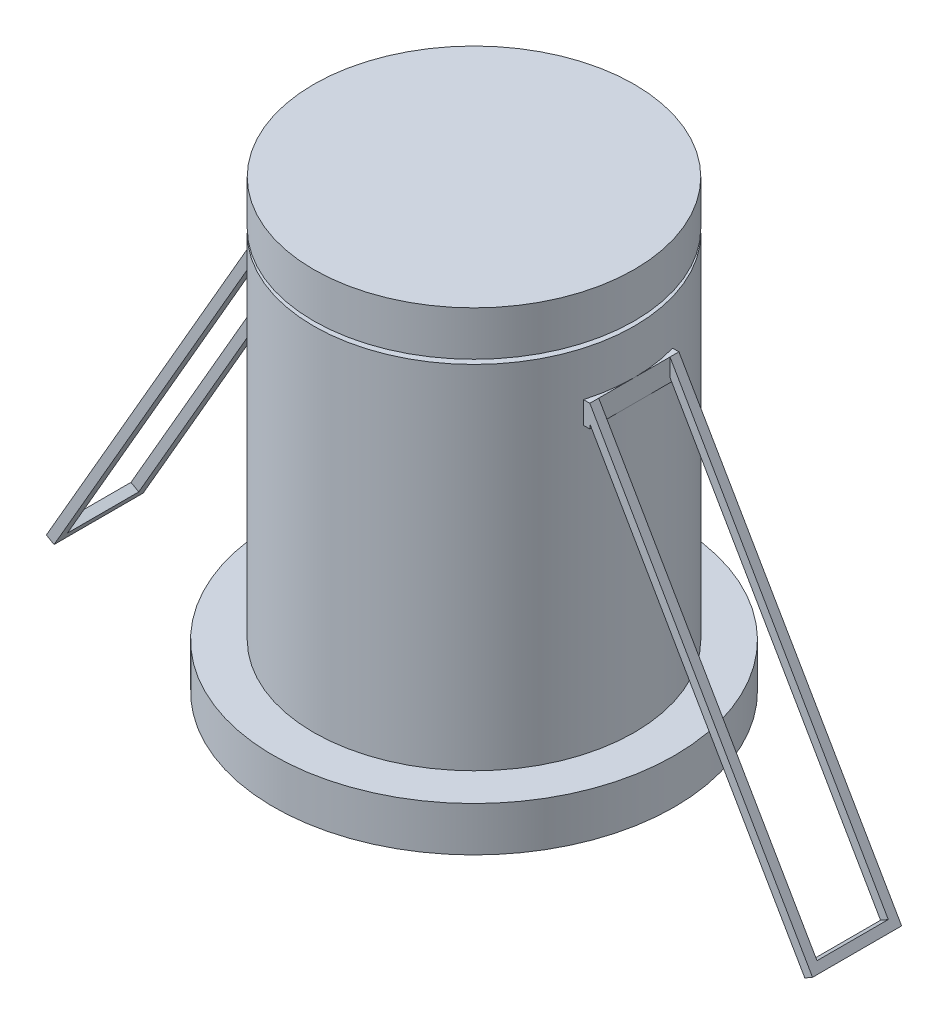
ISO-10303-21;
HEADER;
FILE_DESCRIPTION(('STEP AP214'),'2;1');
FILE_NAME('part.step','',(''),(''),'','','');
FILE_SCHEMA(('AUTOMOTIVE_DESIGN { 1 0 10303 214 1 1 1 1 }'));
ENDSEC;
DATA;
#1=APPLICATION_CONTEXT('core data for automotive mechanical design processes');
#2=APPLICATION_PROTOCOL_DEFINITION('international standard','automotive_design',2000,#1);
#3=PRODUCT_CONTEXT('',#1,'mechanical');
#4=PRODUCT('Part','Part','',(#3));
#5=PRODUCT_RELATED_PRODUCT_CATEGORY('part','',(#4));
#6=PRODUCT_DEFINITION_FORMATION('','',#4);
#7=PRODUCT_DEFINITION_CONTEXT('part definition',#1,'design');
#8=PRODUCT_DEFINITION('design','',#6,#7);
#9=PRODUCT_DEFINITION_SHAPE('','',#8);
#10=(LENGTH_UNIT() NAMED_UNIT(*) SI_UNIT(.MILLI.,.METRE.));
#11=(NAMED_UNIT(*) PLANE_ANGLE_UNIT() SI_UNIT($,.RADIAN.));
#12=(NAMED_UNIT(*) SI_UNIT($,.STERADIAN.) SOLID_ANGLE_UNIT());
#13=UNCERTAINTY_MEASURE_WITH_UNIT(LENGTH_MEASURE(1.E-05),#10,'distance_accuracy_value','');
#14=(GEOMETRIC_REPRESENTATION_CONTEXT(3) GLOBAL_UNCERTAINTY_ASSIGNED_CONTEXT((#13)) GLOBAL_UNIT_ASSIGNED_CONTEXT((#10,
#11,#12)) REPRESENTATION_CONTEXT('',''));
#15=CARTESIAN_POINT('',(0.,0.,0.));
#16=DIRECTION('',(0.,0.,1.));
#17=DIRECTION('',(1.,0.,0.));
#18=AXIS2_PLACEMENT_3D('',#15,#16,#17);
#19=CARTESIAN_POINT('',(-18.,0.,0.));
#20=DIRECTION('',(-1.,0.,0.));
#21=DIRECTION('',(0.,0.,-1.));
#22=AXIS2_PLACEMENT_3D('',#19,#20,#21);
#23=PLANE('',#22);
#24=DIRECTION('',(0.,0.,-1.));
#25=VECTOR('',#24,1.);
#26=CARTESIAN_POINT('',(-18.,37.5,0.));
#27=LINE('',#26,#25);
#28=CARTESIAN_POINT('',(-18.,37.5,5.));
#29=VERTEX_POINT('',#28);
#30=CARTESIAN_POINT('',(-18.,37.5,4.));
#31=VERTEX_POINT('',#30);
#32=EDGE_CURVE('E282',#29,#31,#27,.T.);
#33=ORIENTED_EDGE('',*,*,#32,.T.);
#34=DIRECTION('',(0.,1.,0.));
#35=VECTOR('',#34,1.);
#36=CARTESIAN_POINT('',(-18.,0.,4.));
#37=LINE('',#36,#35);
#38=CARTESIAN_POINT('',(-18.,39.5,4.));
#39=VERTEX_POINT('',#38);
#40=EDGE_CURVE('E232',#31,#39,#37,.T.);
#41=ORIENTED_EDGE('',*,*,#40,.T.);
#42=DIRECTION('',(0.,0.,1.));
#43=VECTOR('',#42,1.);
#44=CARTESIAN_POINT('',(-18.,39.5,-5.));
#45=LINE('',#44,#43);
#46=CARTESIAN_POINT('',(-18.,39.5,0.));
#47=VERTEX_POINT('',#46);
#48=EDGE_CURVE('E307',#47,#39,#45,.T.);
#49=ORIENTED_EDGE('',*,*,#48,.F.);
#50=DIRECTION('',(0.,0.,1.));
#51=VECTOR('',#50,1.);
#52=CARTESIAN_POINT('',(-18.,39.5,-5.));
#53=LINE('',#52,#51);
#54=CARTESIAN_POINT('',(-18.,39.5,-4.));
#55=VERTEX_POINT('',#54);
#56=EDGE_CURVE('E311',#55,#47,#53,.T.);
#57=ORIENTED_EDGE('',*,*,#56,.F.);
#58=DIRECTION('',(0.,-1.,0.));
#59=VECTOR('',#58,1.);
#60=CARTESIAN_POINT('',(-18.,0.,-4.));
#61=LINE('',#60,#59);
#62=CARTESIAN_POINT('',(-18.,37.5,-4.));
#63=VERTEX_POINT('',#62);
#64=EDGE_CURVE('E283',#55,#63,#61,.T.);
#65=ORIENTED_EDGE('',*,*,#64,.T.);
#66=CARTESIAN_POINT('',(-18.,37.5,-5.));
#67=VERTEX_POINT('',#66);
#68=EDGE_CURVE('E278',#63,#67,#27,.T.);
#69=ORIENTED_EDGE('',*,*,#68,.T.);
#70=DIRECTION('',(0.,1.,0.));
#71=VECTOR('',#70,1.);
#72=CARTESIAN_POINT('',(-18.,37.,-5.));
#73=LINE('',#72,#71);
#74=CARTESIAN_POINT('',(-18.,37.,-5.));
#75=VERTEX_POINT('',#74);
#76=EDGE_CURVE('E334',#75,#67,#73,.T.);
#77=ORIENTED_EDGE('',*,*,#76,.F.);
#78=DIRECTION('',(0.,0.,-1.));
#79=VECTOR('',#78,1.);
#80=CARTESIAN_POINT('',(-18.,37.,5.));
#81=LINE('',#80,#79);
#82=CARTESIAN_POINT('',(-18.,37.,0.));
#83=VERTEX_POINT('',#82);
#84=EDGE_CURVE('E338',#83,#75,#81,.T.);
#85=ORIENTED_EDGE('',*,*,#84,.F.);
#86=DIRECTION('',(0.,0.,-1.));
#87=VECTOR('',#86,1.);
#88=CARTESIAN_POINT('',(-18.,37.,5.));
#89=LINE('',#88,#87);
#90=CARTESIAN_POINT('',(-18.,37.,5.));
#91=VERTEX_POINT('',#90);
#92=EDGE_CURVE('E287',#91,#83,#89,.T.);
#93=ORIENTED_EDGE('',*,*,#92,.F.);
#94=DIRECTION('',(0.,-1.,0.));
#95=VECTOR('',#94,1.);
#96=CARTESIAN_POINT('',(-18.,39.5,5.));
#97=LINE('',#96,#95);
#98=EDGE_CURVE('E302',#29,#91,#97,.T.);
#99=ORIENTED_EDGE('',*,*,#98,.F.);
#100=EDGE_LOOP('',(#33,#41,#49,#57,#65,#69,#77,#85,#93,#99));
#101=FACE_BOUND('',#100,.T.);
#102=ADVANCED_FACE('F43',(#101),#23,.T.);
#103=CARTESIAN_POINT('',(0.,15.,0.));
#104=DIRECTION('',(0.,-1.,0.));
#105=DIRECTION('',(1.,0.,0.));
#106=AXIS2_PLACEMENT_3D('',#103,#104,#105);
#107=CYLINDRICAL_SURFACE('',#106,18.);
#108=CARTESIAN_POINT('',(0.,37.,0.));
#109=DIRECTION('',(0.,-1.,0.));
#110=DIRECTION('',(0.,0.,-1.));
#111=AXIS2_PLACEMENT_3D('',#108,#109,#110);
#112=CIRCLE('',#111,18.);
#113=CARTESIAN_POINT('',(18.,37.,0.));
#114=VERTEX_POINT('',#113);
#115=CARTESIAN_POINT('',(17.2916164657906,37.,5.));
#116=VERTEX_POINT('',#115);
#117=EDGE_CURVE('E443',#114,#116,#112,.T.);
#118=ORIENTED_EDGE('',*,*,#117,.T.);
#119=DIRECTION('',(0.,-1.,0.));
#120=VECTOR('',#119,1.);
#121=CARTESIAN_POINT('',(17.2916164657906,15.,5.));
#122=LINE('',#121,#120);
#123=CARTESIAN_POINT('',(17.2916164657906,39.5,5.));
#124=VERTEX_POINT('',#123);
#125=EDGE_CURVE('E439',#116,#124,#122,.F.);
#126=ORIENTED_EDGE('',*,*,#125,.T.);
#127=CARTESIAN_POINT('',(0.,39.5,0.));
#128=DIRECTION('',(0.,1.,0.));
#129=DIRECTION('',(0.,0.,1.));
#130=AXIS2_PLACEMENT_3D('',#127,#128,#129);
#131=CIRCLE('',#130,18.);
#132=CARTESIAN_POINT('',(18.,39.5,0.));
#133=VERTEX_POINT('',#132);
#134=EDGE_CURVE('E425',#124,#133,#131,.T.);
#135=ORIENTED_EDGE('',*,*,#134,.T.);
#136=CARTESIAN_POINT('',(0.,39.5,0.));
#137=DIRECTION('',(0.,1.,0.));
#138=DIRECTION('',(0.,0.,1.));
#139=AXIS2_PLACEMENT_3D('',#136,#137,#138);
#140=CIRCLE('',#139,18.);
#141=CARTESIAN_POINT('',(17.2916164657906,39.5,-5.));
#142=VERTEX_POINT('',#141);
#143=EDGE_CURVE('E466',#133,#142,#140,.T.);
#144=ORIENTED_EDGE('',*,*,#143,.T.);
#145=DIRECTION('',(0.,-1.,0.));
#146=VECTOR('',#145,1.);
#147=CARTESIAN_POINT('',(17.2916164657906,15.,-5.));
#148=LINE('',#147,#146);
#149=CARTESIAN_POINT('',(17.2916164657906,37.,-5.));
#150=VERTEX_POINT('',#149);
#151=EDGE_CURVE('E462',#142,#150,#148,.T.);
#152=ORIENTED_EDGE('',*,*,#151,.T.);
#153=CARTESIAN_POINT('',(0.,37.,0.));
#154=DIRECTION('',(0.,-1.,0.));
#155=DIRECTION('',(0.,0.,-1.));
#156=AXIS2_PLACEMENT_3D('',#153,#154,#155);
#157=CIRCLE('',#156,18.);
#158=EDGE_CURVE('E469',#150,#114,#157,.T.);
#159=ORIENTED_EDGE('',*,*,#158,.T.);
#160=EDGE_LOOP('',(#118,#126,#135,#144,#152,#159));
#161=FACE_BOUND('',#160,.T.);
#162=CARTESIAN_POINT('',(0.,44.5,0.));
#163=DIRECTION('',(0.,-1.,0.));
#164=DIRECTION('',(1.,0.,0.));
#165=AXIS2_PLACEMENT_3D('',#162,#163,#164);
#166=CIRCLE('',#165,18.);
#167=CARTESIAN_POINT('',(18.,44.5,0.));
#168=VERTEX_POINT('',#167);
#169=EDGE_CURVE('E52',#168,#168,#166,.T.);
#170=ORIENTED_EDGE('',*,*,#169,.T.);
#171=EDGE_LOOP('',(#170));
#172=FACE_BOUND('',#171,.T.);
#173=CARTESIAN_POINT('',(0.,5.,0.));
#174=DIRECTION('',(0.,-1.,0.));
#175=DIRECTION('',(1.,0.,0.));
#176=AXIS2_PLACEMENT_3D('',#173,#174,#175);
#177=CIRCLE('',#176,18.);
#178=CARTESIAN_POINT('',(18.,5.,0.));
#179=VERTEX_POINT('',#178);
#180=EDGE_CURVE('E505',#179,#179,#177,.T.);
#181=ORIENTED_EDGE('',*,*,#180,.F.);
#182=EDGE_LOOP('',(#181));
#183=FACE_BOUND('',#182,.T.);
#184=DIRECTION('',(0.,-1.,0.));
#185=VECTOR('',#184,1.);
#186=CARTESIAN_POINT('',(-17.2916164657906,15.,5.));
#187=LINE('',#186,#185);
#188=CARTESIAN_POINT('',(-17.2916164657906,37.,5.));
#189=VERTEX_POINT('',#188);
#190=CARTESIAN_POINT('',(-17.2916164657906,39.5,5.));
#191=VERTEX_POINT('',#190);
#192=EDGE_CURVE('E67',#189,#191,#187,.F.);
#193=ORIENTED_EDGE('',*,*,#192,.F.);
#194=CARTESIAN_POINT('',(0.,37.,0.));
#195=DIRECTION('',(0.,1.,0.));
#196=DIRECTION('',(0.,0.,1.));
#197=AXIS2_PLACEMENT_3D('',#194,#195,#196);
#198=CIRCLE('',#197,18.);
#199=EDGE_CURVE('E288',#83,#189,#198,.T.);
#200=ORIENTED_EDGE('',*,*,#199,.F.);
#201=CARTESIAN_POINT('',(0.,37.,0.));
#202=DIRECTION('',(0.,1.,0.));
#203=DIRECTION('',(0.,0.,1.));
#204=AXIS2_PLACEMENT_3D('',#201,#202,#203);
#205=CIRCLE('',#204,18.);
#206=CARTESIAN_POINT('',(-17.2916164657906,37.,-5.));
#207=VERTEX_POINT('',#206);
#208=EDGE_CURVE('E317',#207,#83,#205,.T.);
#209=ORIENTED_EDGE('',*,*,#208,.F.);
#210=DIRECTION('',(0.,-1.,0.));
#211=VECTOR('',#210,1.);
#212=CARTESIAN_POINT('',(-17.2916164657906,15.,-5.));
#213=LINE('',#212,#211);
#214=CARTESIAN_POINT('',(-17.2916164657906,39.5,-5.));
#215=VERTEX_POINT('',#214);
#216=EDGE_CURVE('E322',#215,#207,#213,.T.);
#217=ORIENTED_EDGE('',*,*,#216,.F.);
#218=CARTESIAN_POINT('',(0.,39.5,0.));
#219=DIRECTION('',(0.,-1.,0.));
#220=DIRECTION('',(0.,0.,-1.));
#221=AXIS2_PLACEMENT_3D('',#218,#219,#220);
#222=CIRCLE('',#221,18.);
#223=EDGE_CURVE('E323',#47,#215,#222,.T.);
#224=ORIENTED_EDGE('',*,*,#223,.F.);
#225=CARTESIAN_POINT('',(0.,39.5,0.));
#226=DIRECTION('',(0.,-1.,0.));
#227=DIRECTION('',(0.,0.,-1.));
#228=AXIS2_PLACEMENT_3D('',#225,#226,#227);
#229=CIRCLE('',#228,18.);
#230=EDGE_CURVE('E303',#191,#47,#229,.T.);
#231=ORIENTED_EDGE('',*,*,#230,.F.);
#232=EDGE_LOOP('',(#193,#200,#209,#217,#224,#231));
#233=FACE_BOUND('',#232,.T.);
#234=ADVANCED_FACE('F512',(#161,#172,#183,#233),#107,.T.);
#235=CARTESIAN_POINT('',(0.,15.,0.));
#236=DIRECTION('',(0.,-1.,0.));
#237=DIRECTION('',(1.,0.,0.));
#238=AXIS2_PLACEMENT_3D('',#235,#236,#237);
#239=CYLINDRICAL_SURFACE('',#238,17.);
#240=CARTESIAN_POINT('',(0.,44.5,0.));
#241=DIRECTION('',(0.,-1.,0.));
#242=DIRECTION('',(1.,0.,0.));
#243=AXIS2_PLACEMENT_3D('',#240,#241,#242);
#244=CIRCLE('',#243,17.);
#245=CARTESIAN_POINT('',(17.,44.5,0.));
#246=VERTEX_POINT('',#245);
#247=EDGE_CURVE('E11',#246,#246,#244,.T.);
#248=ORIENTED_EDGE('',*,*,#247,.F.);
#249=EDGE_LOOP('',(#248));
#250=FACE_BOUND('',#249,.T.);
#251=CARTESIAN_POINT('',(0.,45.,0.));
#252=DIRECTION('',(0.,-1.,0.));
#253=DIRECTION('',(1.,0.,0.));
#254=AXIS2_PLACEMENT_3D('',#251,#252,#253);
#255=CIRCLE('',#254,17.);
#256=CARTESIAN_POINT('',(17.,45.,0.));
#257=VERTEX_POINT('',#256);
#258=EDGE_CURVE('E465',#257,#257,#255,.T.);
#259=ORIENTED_EDGE('',*,*,#258,.T.);
#260=EDGE_LOOP('',(#259));
#261=FACE_BOUND('',#260,.T.);
#262=ADVANCED_FACE('F45',(#250,#261),#239,.T.);
#263=CARTESIAN_POINT('',(-3.08780778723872E-13,44.5,0.));
#264=DIRECTION('',(0.,-1.,0.));
#265=DIRECTION('',(1.,0.,0.));
#266=AXIS2_PLACEMENT_3D('',#263,#264,#265);
#267=PLANE('',#266);
#268=ORIENTED_EDGE('',*,*,#169,.F.);
#269=EDGE_LOOP('',(#268));
#270=FACE_BOUND('',#269,.T.);
#271=ORIENTED_EDGE('',*,*,#247,.T.);
#272=EDGE_LOOP('',(#271));
#273=FACE_BOUND('',#272,.T.);
#274=ADVANCED_FACE('F515',(#270,#273),#267,.F.);
#275=CARTESIAN_POINT('',(0.,5.,0.));
#276=DIRECTION('',(0.,1.,0.));
#277=DIRECTION('',(-1.,0.,0.));
#278=AXIS2_PLACEMENT_3D('',#275,#276,#277);
#279=PLANE('',#278);
#280=ORIENTED_EDGE('',*,*,#180,.T.);
#281=EDGE_LOOP('',(#280));
#282=FACE_BOUND('',#281,.T.);
#283=CARTESIAN_POINT('',(0.,5.,0.));
#284=DIRECTION('',(0.,-1.,0.));
#285=DIRECTION('',(1.,0.,0.));
#286=AXIS2_PLACEMENT_3D('',#283,#284,#285);
#287=CIRCLE('',#286,22.5);
#288=CARTESIAN_POINT('',(22.5,5.,0.));
#289=VERTEX_POINT('',#288);
#290=EDGE_CURVE('E501',#289,#289,#287,.T.);
#291=ORIENTED_EDGE('',*,*,#290,.F.);
#292=EDGE_LOOP('',(#291));
#293=FACE_BOUND('',#292,.T.);
#294=ADVANCED_FACE('F518',(#282,#293),#279,.T.);
#295=CARTESIAN_POINT('',(0.,15.,0.));
#296=DIRECTION('',(0.,-1.,0.));
#297=DIRECTION('',(1.,0.,0.));
#298=AXIS2_PLACEMENT_3D('',#295,#296,#297);
#299=CYLINDRICAL_SURFACE('',#298,22.5);
#300=ORIENTED_EDGE('',*,*,#290,.T.);
#301=EDGE_LOOP('',(#300));
#302=FACE_BOUND('',#301,.T.);
#303=CARTESIAN_POINT('',(0.,0.,0.));
#304=DIRECTION('',(0.,-1.,0.));
#305=DIRECTION('',(1.,0.,0.));
#306=AXIS2_PLACEMENT_3D('',#303,#304,#305);
#307=CIRCLE('',#306,22.5);
#308=CARTESIAN_POINT('',(22.5,0.,0.));
#309=VERTEX_POINT('',#308);
#310=EDGE_CURVE('E497',#309,#309,#307,.T.);
#311=ORIENTED_EDGE('',*,*,#310,.F.);
#312=EDGE_LOOP('',(#311));
#313=FACE_BOUND('',#312,.T.);
#314=ADVANCED_FACE('F793',(#302,#313),#299,.T.);
#315=CARTESIAN_POINT('',(0.,0.,0.));
#316=DIRECTION('',(0.,-1.,0.));
#317=DIRECTION('',(1.,0.,0.));
#318=AXIS2_PLACEMENT_3D('',#315,#316,#317);
#319=PLANE('',#318);
#320=ORIENTED_EDGE('',*,*,#310,.T.);
#321=EDGE_LOOP('',(#320));
#322=FACE_BOUND('',#321,.T.);
#323=CARTESIAN_POINT('',(0.,0.,0.));
#324=DIRECTION('',(0.,-1.,0.));
#325=DIRECTION('',(1.,0.,0.));
#326=AXIS2_PLACEMENT_3D('',#323,#324,#325);
#327=CIRCLE('',#326,15.);
#328=CARTESIAN_POINT('',(15.,0.,0.));
#329=VERTEX_POINT('',#328);
#330=EDGE_CURVE('E493',#329,#329,#327,.T.);
#331=ORIENTED_EDGE('',*,*,#330,.F.);
#332=EDGE_LOOP('',(#331));
#333=FACE_BOUND('',#332,.T.);
#334=ADVANCED_FACE('F801',(#322,#333),#319,.T.);
#335=CARTESIAN_POINT('',(0.,15.,0.));
#336=DIRECTION('',(0.,-1.,0.));
#337=DIRECTION('',(1.,0.,0.));
#338=AXIS2_PLACEMENT_3D('',#335,#336,#337);
#339=CYLINDRICAL_SURFACE('',#338,15.);
#340=CARTESIAN_POINT('',(0.,15.,0.));
#341=DIRECTION('',(0.,-1.,0.));
#342=DIRECTION('',(1.,0.,0.));
#343=AXIS2_PLACEMENT_3D('',#340,#341,#342);
#344=CIRCLE('',#343,15.);
#345=CARTESIAN_POINT('',(15.,15.,0.));
#346=VERTEX_POINT('',#345);
#347=EDGE_CURVE('E489',#346,#346,#344,.T.);
#348=ORIENTED_EDGE('',*,*,#347,.F.);
#349=EDGE_LOOP('',(#348));
#350=FACE_BOUND('',#349,.T.);
#351=ORIENTED_EDGE('',*,*,#330,.T.);
#352=EDGE_LOOP('',(#351));
#353=FACE_BOUND('',#352,.T.);
#354=ADVANCED_FACE('F545',(#350,#353),#339,.F.);
#355=CARTESIAN_POINT('',(0.,15.,0.));
#356=DIRECTION('',(0.,1.,0.));
#357=DIRECTION('',(-1.,0.,0.));
#358=AXIS2_PLACEMENT_3D('',#355,#356,#357);
#359=PLANE('',#358);
#360=ORIENTED_EDGE('',*,*,#347,.T.);
#361=EDGE_LOOP('',(#360));
#362=FACE_BOUND('',#361,.T.);
#363=ADVANCED_FACE('F540',(#362),#359,.F.);
#364=CARTESIAN_POINT('',(0.,50.,0.));
#365=DIRECTION('',(0.,1.,0.));
#366=DIRECTION('',(-1.,0.,0.));
#367=AXIS2_PLACEMENT_3D('',#364,#365,#366);
#368=PLANE('',#367);
#369=CARTESIAN_POINT('',(0.,50.,0.));
#370=DIRECTION('',(0.,-1.,0.));
#371=DIRECTION('',(1.,0.,0.));
#372=AXIS2_PLACEMENT_3D('',#369,#370,#371);
#373=CIRCLE('',#372,18.);
#374=CARTESIAN_POINT('',(18.,50.,0.));
#375=VERTEX_POINT('',#374);
#376=EDGE_CURVE('E485',#375,#375,#373,.T.);
#377=ORIENTED_EDGE('',*,*,#376,.F.);
#378=EDGE_LOOP('',(#377));
#379=FACE_BOUND('',#378,.T.);
#380=ADVANCED_FACE('F535',(#379),#368,.T.);
#381=CARTESIAN_POINT('',(0.,15.,0.));
#382=DIRECTION('',(0.,-1.,0.));
#383=DIRECTION('',(1.,0.,0.));
#384=AXIS2_PLACEMENT_3D('',#381,#382,#383);
#385=CYLINDRICAL_SURFACE('',#384,18.);
#386=CARTESIAN_POINT('',(0.,45.,0.));
#387=DIRECTION('',(0.,-1.,0.));
#388=DIRECTION('',(1.,0.,0.));
#389=AXIS2_PLACEMENT_3D('',#386,#387,#388);
#390=CIRCLE('',#389,18.);
#391=CARTESIAN_POINT('',(18.,45.,0.));
#392=VERTEX_POINT('',#391);
#393=EDGE_CURVE('E481',#392,#392,#390,.T.);
#394=ORIENTED_EDGE('',*,*,#393,.F.);
#395=EDGE_LOOP('',(#394));
#396=FACE_BOUND('',#395,.T.);
#397=ORIENTED_EDGE('',*,*,#376,.T.);
#398=EDGE_LOOP('',(#397));
#399=FACE_BOUND('',#398,.T.);
#400=ADVANCED_FACE('F529',(#396,#399),#385,.T.);
#401=CARTESIAN_POINT('',(0.,45.,0.));
#402=DIRECTION('',(0.,1.,0.));
#403=DIRECTION('',(-1.,0.,0.));
#404=AXIS2_PLACEMENT_3D('',#401,#402,#403);
#405=PLANE('',#404);
#406=ORIENTED_EDGE('',*,*,#258,.F.);
#407=EDGE_LOOP('',(#406));
#408=FACE_BOUND('',#407,.T.);
#409=ORIENTED_EDGE('',*,*,#393,.T.);
#410=EDGE_LOOP('',(#409));
#411=FACE_BOUND('',#410,.T.);
#412=ADVANCED_FACE('F525',(#408,#411),#405,.F.);
#413=CARTESIAN_POINT('',(18.,0.,0.));
#414=DIRECTION('',(1.,0.,0.));
#415=DIRECTION('',(0.,0.,-1.));
#416=AXIS2_PLACEMENT_3D('',#413,#414,#415);
#417=PLANE('',#416);
#418=DIRECTION('',(0.,-1.,0.));
#419=VECTOR('',#418,1.);
#420=CARTESIAN_POINT('',(18.,0.,-4.));
#421=LINE('',#420,#419);
#422=CARTESIAN_POINT('',(18.,39.5,-4.));
#423=VERTEX_POINT('',#422);
#424=CARTESIAN_POINT('',(18.,37.5,-4.));
#425=VERTEX_POINT('',#424);
#426=EDGE_CURVE('E417',#423,#425,#421,.T.);
#427=ORIENTED_EDGE('',*,*,#426,.F.);
#428=DIRECTION('',(0.,0.,1.));
#429=VECTOR('',#428,1.);
#430=CARTESIAN_POINT('',(18.,39.5,-5.));
#431=LINE('',#430,#429);
#432=EDGE_CURVE('E442',#423,#133,#431,.T.);
#433=ORIENTED_EDGE('',*,*,#432,.T.);
#434=DIRECTION('',(0.,0.,1.));
#435=VECTOR('',#434,1.);
#436=CARTESIAN_POINT('',(18.,39.5,-5.));
#437=LINE('',#436,#435);
#438=CARTESIAN_POINT('',(18.,39.5,4.));
#439=VERTEX_POINT('',#438);
#440=EDGE_CURVE('E421',#133,#439,#437,.T.);
#441=ORIENTED_EDGE('',*,*,#440,.T.);
#442=DIRECTION('',(0.,1.,0.));
#443=VECTOR('',#442,1.);
#444=CARTESIAN_POINT('',(18.,0.,4.));
#445=LINE('',#444,#443);
#446=CARTESIAN_POINT('',(18.,37.5,4.));
#447=VERTEX_POINT('',#446);
#448=EDGE_CURVE('E401',#447,#439,#445,.T.);
#449=ORIENTED_EDGE('',*,*,#448,.F.);
#450=DIRECTION('',(0.,0.,1.));
#451=VECTOR('',#450,1.);
#452=CARTESIAN_POINT('',(18.,37.5,0.));
#453=LINE('',#452,#451);
#454=CARTESIAN_POINT('',(18.,37.5,5.));
#455=VERTEX_POINT('',#454);
#456=EDGE_CURVE('E413',#447,#455,#453,.T.);
#457=ORIENTED_EDGE('',*,*,#456,.T.);
#458=DIRECTION('',(0.,-1.,0.));
#459=VECTOR('',#458,1.);
#460=CARTESIAN_POINT('',(18.,39.5,5.));
#461=LINE('',#460,#459);
#462=CARTESIAN_POINT('',(18.,37.,5.));
#463=VERTEX_POINT('',#462);
#464=EDGE_CURVE('E433',#455,#463,#461,.T.);
#465=ORIENTED_EDGE('',*,*,#464,.T.);
#466=DIRECTION('',(0.,0.,-1.));
#467=VECTOR('',#466,1.);
#468=CARTESIAN_POINT('',(18.,37.,5.));
#469=LINE('',#468,#467);
#470=EDGE_CURVE('E430',#463,#114,#469,.T.);
#471=ORIENTED_EDGE('',*,*,#470,.T.);
#472=DIRECTION('',(0.,0.,-1.));
#473=VECTOR('',#472,1.);
#474=CARTESIAN_POINT('',(18.,37.,5.));
#475=LINE('',#474,#473);
#476=CARTESIAN_POINT('',(18.,37.,-5.));
#477=VERTEX_POINT('',#476);
#478=EDGE_CURVE('E454',#114,#477,#475,.T.);
#479=ORIENTED_EDGE('',*,*,#478,.T.);
#480=DIRECTION('',(0.,1.,0.));
#481=VECTOR('',#480,1.);
#482=CARTESIAN_POINT('',(18.,37.,-5.));
#483=LINE('',#482,#481);
#484=CARTESIAN_POINT('',(18.,37.5,-5.));
#485=VERTEX_POINT('',#484);
#486=EDGE_CURVE('E450',#477,#485,#483,.T.);
#487=ORIENTED_EDGE('',*,*,#486,.T.);
#488=EDGE_CURVE('E416',#485,#425,#453,.T.);
#489=ORIENTED_EDGE('',*,*,#488,.T.);
#490=EDGE_LOOP('',(#427,#433,#441,#449,#457,#465,#471,#479,#487,#489));
#491=FACE_BOUND('',#490,.T.);
#492=ADVANCED_FACE('F528',(#491),#417,.T.);
#493=CARTESIAN_POINT('',(-22.501,37.,5.));
#494=DIRECTION('',(0.,-1.,0.));
#495=DIRECTION('',(0.,0.,-1.));
#496=AXIS2_PLACEMENT_3D('',#493,#494,#495);
#497=PLANE('',#496);
#498=ORIENTED_EDGE('',*,*,#158,.F.);
#499=DIRECTION('',(1.,0.,0.));
#500=VECTOR('',#499,1.);
#501=CARTESIAN_POINT('',(-22.501,37.,-5.));
#502=LINE('',#501,#500);
#503=EDGE_CURVE('E453',#150,#477,#502,.T.);
#504=ORIENTED_EDGE('',*,*,#503,.T.);
#505=ORIENTED_EDGE('',*,*,#478,.F.);
#506=EDGE_LOOP('',(#498,#504,#505));
#507=FACE_BOUND('',#506,.T.);
#508=ADVANCED_FACE('F612',(#507),#497,.T.);
#509=CARTESIAN_POINT('',(-22.501,37.,-5.));
#510=DIRECTION('',(0.,0.,-1.));
#511=DIRECTION('',(-1.,0.,0.));
#512=AXIS2_PLACEMENT_3D('',#509,#510,#511);
#513=PLANE('',#512);
#514=DIRECTION('',(1.,0.,0.));
#515=VECTOR('',#514,1.);
#516=CARTESIAN_POINT('',(-22.501,39.5,-5.));
#517=LINE('',#516,#515);
#518=CARTESIAN_POINT('',(18.,39.5,-5.));
#519=VERTEX_POINT('',#518);
#520=EDGE_CURVE('E473',#142,#519,#517,.T.);
#521=ORIENTED_EDGE('',*,*,#520,.T.);
#522=DIRECTION('',(-0.500000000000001,0.866025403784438,0.));
#523=VECTOR('',#522,1.);
#524=CARTESIAN_POINT('',(18.,39.5,-5.));
#525=LINE('',#524,#523);
#526=CARTESIAN_POINT('',(43.,-3.80127018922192,-5.));
#527=VERTEX_POINT('',#526);
#528=EDGE_CURVE('E383',#527,#519,#525,.T.);
#529=ORIENTED_EDGE('',*,*,#528,.F.);
#530=DIRECTION('',(0.866025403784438,0.500000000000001,0.));
#531=VECTOR('',#530,1.);
#532=CARTESIAN_POINT('',(42.1339745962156,-4.30127018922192,-5.));
#533=LINE('',#532,#531);
#534=CARTESIAN_POINT('',(42.1339745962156,-4.30127018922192,-5.));
#535=VERTEX_POINT('',#534);
#536=EDGE_CURVE('E405',#535,#527,#533,.T.);
#537=ORIENTED_EDGE('',*,*,#536,.F.);
#538=DIRECTION('',(-0.500000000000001,0.866025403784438,0.));
#539=VECTOR('',#538,1.);
#540=CARTESIAN_POINT('',(17.1339745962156,39.,-5.));
#541=LINE('',#540,#539);
#542=EDGE_CURVE('E356',#535,#485,#541,.T.);
#543=ORIENTED_EDGE('',*,*,#542,.T.);
#544=ORIENTED_EDGE('',*,*,#486,.F.);
#545=ORIENTED_EDGE('',*,*,#503,.F.);
#546=ORIENTED_EDGE('',*,*,#151,.F.);
#547=EDGE_LOOP('',(#521,#529,#537,#543,#544,#545,#546));
#548=FACE_BOUND('',#547,.T.);
#549=ADVANCED_FACE('F616',(#548),#513,.T.);
#550=CARTESIAN_POINT('',(-22.501,39.5,-5.));
#551=DIRECTION('',(0.,1.,0.));
#552=DIRECTION('',(0.,0.,1.));
#553=AXIS2_PLACEMENT_3D('',#550,#551,#552);
#554=PLANE('',#553);
#555=ORIENTED_EDGE('',*,*,#143,.F.);
#556=ORIENTED_EDGE('',*,*,#432,.F.);
#557=EDGE_CURVE('E458',#519,#423,#431,.T.);
#558=ORIENTED_EDGE('',*,*,#557,.F.);
#559=ORIENTED_EDGE('',*,*,#520,.F.);
#560=EDGE_LOOP('',(#555,#556,#558,#559));
#561=FACE_BOUND('',#560,.T.);
#562=ADVANCED_FACE('F605',(#561),#554,.T.);
#563=CARTESIAN_POINT('',(-22.501,39.5,5.));
#564=DIRECTION('',(0.,0.,1.));
#565=DIRECTION('',(1.,0.,0.));
#566=AXIS2_PLACEMENT_3D('',#563,#564,#565);
#567=PLANE('',#566);
#568=DIRECTION('',(1.,0.,0.));
#569=VECTOR('',#568,1.);
#570=CARTESIAN_POINT('',(-22.501,39.5,5.));
#571=LINE('',#570,#569);
#572=CARTESIAN_POINT('',(18.,39.5,5.));
#573=VERTEX_POINT('',#572);
#574=EDGE_CURVE('E422',#124,#573,#571,.T.);
#575=ORIENTED_EDGE('',*,*,#574,.F.);
#576=ORIENTED_EDGE('',*,*,#125,.F.);
#577=DIRECTION('',(1.,0.,0.));
#578=VECTOR('',#577,1.);
#579=CARTESIAN_POINT('',(-22.501,37.,5.));
#580=LINE('',#579,#578);
#581=EDGE_CURVE('E426',#116,#463,#580,.T.);
#582=ORIENTED_EDGE('',*,*,#581,.T.);
#583=ORIENTED_EDGE('',*,*,#464,.F.);
#584=DIRECTION('',(0.500000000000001,-0.866025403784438,0.));
#585=VECTOR('',#584,1.);
#586=CARTESIAN_POINT('',(17.1339745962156,39.,5.));
#587=LINE('',#586,#585);
#588=CARTESIAN_POINT('',(42.1339745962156,-4.30127018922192,5.));
#589=VERTEX_POINT('',#588);
#590=EDGE_CURVE('E348',#455,#589,#587,.T.);
#591=ORIENTED_EDGE('',*,*,#590,.T.);
#592=DIRECTION('',(0.866025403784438,0.500000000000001,0.));
#593=VECTOR('',#592,1.);
#594=CARTESIAN_POINT('',(42.1339745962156,-4.30127018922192,5.));
#595=LINE('',#594,#593);
#596=CARTESIAN_POINT('',(43.,-3.80127018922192,5.));
#597=VERTEX_POINT('',#596);
#598=EDGE_CURVE('E371',#589,#597,#595,.T.);
#599=ORIENTED_EDGE('',*,*,#598,.T.);
#600=DIRECTION('',(0.500000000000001,-0.866025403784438,0.));
#601=VECTOR('',#600,1.);
#602=CARTESIAN_POINT('',(18.,39.5,5.));
#603=LINE('',#602,#601);
#604=EDGE_CURVE('E375',#573,#597,#603,.T.);
#605=ORIENTED_EDGE('',*,*,#604,.F.);
#606=EDGE_LOOP('',(#575,#576,#582,#583,#591,#599,#605));
#607=FACE_BOUND('',#606,.T.);
#608=ADVANCED_FACE('F602',(#607),#567,.T.);
#609=CARTESIAN_POINT('',(-22.501,37.,5.));
#610=DIRECTION('',(0.,-1.,0.));
#611=DIRECTION('',(0.,0.,-1.));
#612=AXIS2_PLACEMENT_3D('',#609,#610,#611);
#613=PLANE('',#612);
#614=ORIENTED_EDGE('',*,*,#117,.F.);
#615=ORIENTED_EDGE('',*,*,#470,.F.);
#616=ORIENTED_EDGE('',*,*,#581,.F.);
#617=EDGE_LOOP('',(#614,#615,#616));
#618=FACE_BOUND('',#617,.T.);
#619=ADVANCED_FACE('F600',(#618),#613,.T.);
#620=CARTESIAN_POINT('',(-22.501,39.5,-5.));
#621=DIRECTION('',(0.,1.,0.));
#622=DIRECTION('',(0.,0.,1.));
#623=AXIS2_PLACEMENT_3D('',#620,#621,#622);
#624=PLANE('',#623);
#625=ORIENTED_EDGE('',*,*,#134,.F.);
#626=ORIENTED_EDGE('',*,*,#574,.T.);
#627=DIRECTION('',(0.,0.,1.));
#628=VECTOR('',#627,1.);
#629=CARTESIAN_POINT('',(18.,39.5,4.));
#630=LINE('',#629,#628);
#631=EDGE_CURVE('E321',#439,#573,#630,.T.);
#632=ORIENTED_EDGE('',*,*,#631,.F.);
#633=ORIENTED_EDGE('',*,*,#440,.F.);
#634=EDGE_LOOP('',(#625,#626,#632,#633));
#635=FACE_BOUND('',#634,.T.);
#636=ADVANCED_FACE('F586',(#635),#624,.T.);
#637=CARTESIAN_POINT('',(17.1339745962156,39.,4.));
#638=DIRECTION('',(0.,0.,-1.));
#639=DIRECTION('',(-1.,0.,0.));
#640=AXIS2_PLACEMENT_3D('',#637,#638,#639);
#641=PLANE('',#640);
#642=DIRECTION('',(-0.500000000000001,0.866025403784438,0.));
#643=VECTOR('',#642,1.);
#644=CARTESIAN_POINT('',(17.1339745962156,39.,4.));
#645=LINE('',#644,#643);
#646=CARTESIAN_POINT('',(41.6339745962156,-3.43524478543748,4.));
#647=VERTEX_POINT('',#646);
#648=EDGE_CURVE('E367',#647,#447,#645,.T.);
#649=ORIENTED_EDGE('',*,*,#648,.T.);
#650=ORIENTED_EDGE('',*,*,#448,.T.);
#651=DIRECTION('',(-0.500000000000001,0.866025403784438,0.));
#652=VECTOR('',#651,1.);
#653=CARTESIAN_POINT('',(18.,39.5,4.));
#654=LINE('',#653,#652);
#655=CARTESIAN_POINT('',(42.5,-2.93524478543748,4.));
#656=VERTEX_POINT('',#655);
#657=EDGE_CURVE('E352',#656,#439,#654,.T.);
#658=ORIENTED_EDGE('',*,*,#657,.F.);
#659=DIRECTION('',(0.866025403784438,0.500000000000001,0.));
#660=VECTOR('',#659,1.);
#661=CARTESIAN_POINT('',(41.6339745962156,-3.43524478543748,4.));
#662=LINE('',#661,#660);
#663=EDGE_CURVE('E398',#647,#656,#662,.T.);
#664=ORIENTED_EDGE('',*,*,#663,.F.);
#665=EDGE_LOOP('',(#649,#650,#658,#664));
#666=FACE_BOUND('',#665,.T.);
#667=ADVANCED_FACE('F582',(#666),#641,.T.);
#668=CARTESIAN_POINT('',(41.6339745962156,-3.43524478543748,4.));
#669=DIRECTION('',(-0.500000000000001,0.866025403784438,0.));
#670=DIRECTION('',(-0.866025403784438,-0.500000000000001,0.));
#671=AXIS2_PLACEMENT_3D('',#668,#669,#670);
#672=PLANE('',#671);
#673=DIRECTION('',(0.,0.,1.));
#674=VECTOR('',#673,1.);
#675=CARTESIAN_POINT('',(42.5,-2.93524478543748,4.));
#676=LINE('',#675,#674);
#677=CARTESIAN_POINT('',(42.5,-2.93524478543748,-4.));
#678=VERTEX_POINT('',#677);
#679=EDGE_CURVE('E391',#678,#656,#676,.T.);
#680=ORIENTED_EDGE('',*,*,#679,.F.);
#681=DIRECTION('',(0.866025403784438,0.500000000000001,0.));
#682=VECTOR('',#681,1.);
#683=CARTESIAN_POINT('',(41.6339745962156,-3.43524478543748,-4.));
#684=LINE('',#683,#682);
#685=CARTESIAN_POINT('',(41.6339745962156,-3.43524478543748,-4.));
#686=VERTEX_POINT('',#685);
#687=EDGE_CURVE('E402',#686,#678,#684,.T.);
#688=ORIENTED_EDGE('',*,*,#687,.F.);
#689=DIRECTION('',(0.,0.,1.));
#690=VECTOR('',#689,1.);
#691=CARTESIAN_POINT('',(41.6339745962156,-3.43524478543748,4.));
#692=LINE('',#691,#690);
#693=EDGE_CURVE('E363',#686,#647,#692,.T.);
#694=ORIENTED_EDGE('',*,*,#693,.T.);
#695=ORIENTED_EDGE('',*,*,#663,.T.);
#696=EDGE_LOOP('',(#680,#688,#694,#695));
#697=FACE_BOUND('',#696,.T.);
#698=ADVANCED_FACE('F585',(#697),#672,.T.);
#699=CARTESIAN_POINT('',(17.1339745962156,39.,-4.));
#700=DIRECTION('',(0.,0.,1.));
#701=DIRECTION('',(1.,0.,0.));
#702=AXIS2_PLACEMENT_3D('',#699,#700,#701);
#703=PLANE('',#702);
#704=DIRECTION('',(0.500000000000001,-0.866025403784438,0.));
#705=VECTOR('',#704,1.);
#706=CARTESIAN_POINT('',(18.,39.5,-4.));
#707=LINE('',#706,#705);
#708=EDGE_CURVE('E387',#423,#678,#707,.T.);
#709=ORIENTED_EDGE('',*,*,#708,.F.);
#710=ORIENTED_EDGE('',*,*,#426,.T.);
#711=DIRECTION('',(0.500000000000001,-0.866025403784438,0.));
#712=VECTOR('',#711,1.);
#713=CARTESIAN_POINT('',(17.1339745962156,39.,-4.));
#714=LINE('',#713,#712);
#715=EDGE_CURVE('E360',#425,#686,#714,.T.);
#716=ORIENTED_EDGE('',*,*,#715,.T.);
#717=ORIENTED_EDGE('',*,*,#687,.T.);
#718=EDGE_LOOP('',(#709,#710,#716,#717));
#719=FACE_BOUND('',#718,.T.);
#720=ADVANCED_FACE('F590',(#719),#703,.T.);
#721=CARTESIAN_POINT('',(42.1339745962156,-4.30127018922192,5.));
#722=DIRECTION('',(0.500000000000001,-0.866025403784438,0.));
#723=DIRECTION('',(0.866025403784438,0.500000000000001,0.));
#724=AXIS2_PLACEMENT_3D('',#721,#722,#723);
#725=PLANE('',#724);
#726=DIRECTION('',(0.,0.,-1.));
#727=VECTOR('',#726,1.);
#728=CARTESIAN_POINT('',(43.,-3.80127018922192,5.));
#729=LINE('',#728,#727);
#730=EDGE_CURVE('E379',#597,#527,#729,.T.);
#731=ORIENTED_EDGE('',*,*,#730,.F.);
#732=ORIENTED_EDGE('',*,*,#598,.F.);
#733=DIRECTION('',(0.,0.,-1.));
#734=VECTOR('',#733,1.);
#735=CARTESIAN_POINT('',(42.1339745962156,-4.30127018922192,5.));
#736=LINE('',#735,#734);
#737=EDGE_CURVE('E351',#589,#535,#736,.T.);
#738=ORIENTED_EDGE('',*,*,#737,.T.);
#739=ORIENTED_EDGE('',*,*,#536,.T.);
#740=EDGE_LOOP('',(#731,#732,#738,#739));
#741=FACE_BOUND('',#740,.T.);
#742=ADVANCED_FACE('F577',(#741),#725,.T.);
#743=CARTESIAN_POINT('',(29.7379763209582,17.16922863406,0.));
#744=DIRECTION('',(0.866025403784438,0.500000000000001,0.));
#745=DIRECTION('',(-0.500000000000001,0.866025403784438,0.));
#746=AXIS2_PLACEMENT_3D('',#743,#744,#745);
#747=PLANE('',#746);
#748=ORIENTED_EDGE('',*,*,#488,.F.);
#749=ORIENTED_EDGE('',*,*,#542,.F.);
#750=ORIENTED_EDGE('',*,*,#737,.F.);
#751=ORIENTED_EDGE('',*,*,#590,.F.);
#752=ORIENTED_EDGE('',*,*,#456,.F.);
#753=ORIENTED_EDGE('',*,*,#648,.F.);
#754=ORIENTED_EDGE('',*,*,#693,.F.);
#755=ORIENTED_EDGE('',*,*,#715,.F.);
#756=EDGE_LOOP('',(#748,#749,#750,#751,#752,#753,#754,#755));
#757=FACE_BOUND('',#756,.T.);
#758=ADVANCED_FACE('F574',(#757),#747,.F.);
#759=CARTESIAN_POINT('',(30.6040017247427,17.66922863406,0.));
#760=DIRECTION('',(0.866025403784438,0.500000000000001,0.));
#761=DIRECTION('',(-0.500000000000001,0.866025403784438,0.));
#762=AXIS2_PLACEMENT_3D('',#759,#760,#761);
#763=PLANE('',#762);
#764=ORIENTED_EDGE('',*,*,#631,.T.);
#765=ORIENTED_EDGE('',*,*,#604,.T.);
#766=ORIENTED_EDGE('',*,*,#730,.T.);
#767=ORIENTED_EDGE('',*,*,#528,.T.);
#768=ORIENTED_EDGE('',*,*,#557,.T.);
#769=ORIENTED_EDGE('',*,*,#708,.T.);
#770=ORIENTED_EDGE('',*,*,#679,.T.);
#771=ORIENTED_EDGE('',*,*,#657,.T.);
#772=EDGE_LOOP('',(#764,#765,#766,#767,#768,#769,#770,#771));
#773=FACE_BOUND('',#772,.T.);
#774=ADVANCED_FACE('F568',(#773),#763,.T.);
#775=CARTESIAN_POINT('',(43.0010000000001,37.,-5.));
#776=DIRECTION('',(0.,0.,1.));
#777=DIRECTION('',(1.,0.,0.));
#778=AXIS2_PLACEMENT_3D('',#775,#776,#777);
#779=PLANE('',#778);
#780=ORIENTED_EDGE('',*,*,#76,.T.);
#781=DIRECTION('',(0.500000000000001,0.866025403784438,0.));
#782=VECTOR('',#781,1.);
#783=CARTESIAN_POINT('',(-17.1339745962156,39.,-5.));
#784=LINE('',#783,#782);
#785=CARTESIAN_POINT('',(-42.1339745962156,-4.30127018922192,-5.));
#786=VERTEX_POINT('',#785);
#787=EDGE_CURVE('E242',#786,#67,#784,.T.);
#788=ORIENTED_EDGE('',*,*,#787,.F.);
#789=DIRECTION('',(-0.866025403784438,0.500000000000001,0.));
#790=VECTOR('',#789,1.);
#791=CARTESIAN_POINT('',(-42.1339745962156,-4.30127018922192,-5.));
#792=LINE('',#791,#790);
#793=CARTESIAN_POINT('',(-43.,-3.80127018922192,-5.));
#794=VERTEX_POINT('',#793);
#795=EDGE_CURVE('E270',#786,#794,#792,.T.);
#796=ORIENTED_EDGE('',*,*,#795,.T.);
#797=DIRECTION('',(0.500000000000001,0.866025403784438,0.));
#798=VECTOR('',#797,1.);
#799=CARTESIAN_POINT('',(-18.,39.5,-5.));
#800=LINE('',#799,#798);
#801=CARTESIAN_POINT('',(-18.,39.5,-5.));
#802=VERTEX_POINT('',#801);
#803=EDGE_CURVE('E261',#794,#802,#800,.T.);
#804=ORIENTED_EDGE('',*,*,#803,.T.);
#805=DIRECTION('',(-1.,0.,0.));
#806=VECTOR('',#805,1.);
#807=CARTESIAN_POINT('',(43.0010000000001,39.5,-5.));
#808=LINE('',#807,#806);
#809=EDGE_CURVE('E342',#215,#802,#808,.T.);
#810=ORIENTED_EDGE('',*,*,#809,.F.);
#811=ORIENTED_EDGE('',*,*,#216,.T.);
#812=DIRECTION('',(-1.,0.,0.));
#813=VECTOR('',#812,1.);
#814=CARTESIAN_POINT('',(43.0010000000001,37.,-5.));
#815=LINE('',#814,#813);
#816=EDGE_CURVE('E327',#207,#75,#815,.T.);
#817=ORIENTED_EDGE('',*,*,#816,.T.);
#818=EDGE_LOOP('',(#780,#788,#796,#804,#810,#811,#817));
#819=FACE_BOUND('',#818,.T.);
#820=ADVANCED_FACE('F564',(#819),#779,.F.);
#821=CARTESIAN_POINT('',(43.0010000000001,37.,5.));
#822=DIRECTION('',(0.,1.,0.));
#823=DIRECTION('',(0.,0.,1.));
#824=AXIS2_PLACEMENT_3D('',#821,#822,#823);
#825=PLANE('',#824);
#826=ORIENTED_EDGE('',*,*,#816,.F.);
#827=ORIENTED_EDGE('',*,*,#208,.T.);
#828=ORIENTED_EDGE('',*,*,#84,.T.);
#829=EDGE_LOOP('',(#826,#827,#828));
#830=FACE_BOUND('',#829,.T.);
#831=ADVANCED_FACE('F560',(#830),#825,.F.);
#832=CARTESIAN_POINT('',(43.0010000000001,39.5,-5.));
#833=DIRECTION('',(0.,-1.,0.));
#834=DIRECTION('',(0.,0.,-1.));
#835=AXIS2_PLACEMENT_3D('',#832,#833,#834);
#836=PLANE('',#835);
#837=EDGE_CURVE('E330',#802,#55,#53,.T.);
#838=ORIENTED_EDGE('',*,*,#837,.T.);
#839=ORIENTED_EDGE('',*,*,#56,.T.);
#840=ORIENTED_EDGE('',*,*,#223,.T.);
#841=ORIENTED_EDGE('',*,*,#809,.T.);
#842=EDGE_LOOP('',(#838,#839,#840,#841));
#843=FACE_BOUND('',#842,.T.);
#844=ADVANCED_FACE('F563',(#843),#836,.F.);
#845=CARTESIAN_POINT('',(43.0010000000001,37.,5.));
#846=DIRECTION('',(0.,1.,0.));
#847=DIRECTION('',(0.,0.,1.));
#848=AXIS2_PLACEMENT_3D('',#845,#846,#847);
#849=PLANE('',#848);
#850=ORIENTED_EDGE('',*,*,#92,.T.);
#851=ORIENTED_EDGE('',*,*,#199,.T.);
#852=DIRECTION('',(-1.,0.,0.));
#853=VECTOR('',#852,1.);
#854=CARTESIAN_POINT('',(43.0010000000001,37.,5.));
#855=LINE('',#854,#853);
#856=EDGE_CURVE('E292',#189,#91,#855,.T.);
#857=ORIENTED_EDGE('',*,*,#856,.T.);
#858=EDGE_LOOP('',(#850,#851,#857));
#859=FACE_BOUND('',#858,.T.);
#860=ADVANCED_FACE('F572',(#859),#849,.F.);
#861=CARTESIAN_POINT('',(43.0010000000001,39.5,5.));
#862=DIRECTION('',(0.,0.,-1.));
#863=DIRECTION('',(-1.,0.,0.));
#864=AXIS2_PLACEMENT_3D('',#861,#862,#863);
#865=PLANE('',#864);
#866=ORIENTED_EDGE('',*,*,#192,.T.);
#867=DIRECTION('',(-1.,0.,0.));
#868=VECTOR('',#867,1.);
#869=CARTESIAN_POINT('',(43.0010000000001,39.5,5.));
#870=LINE('',#869,#868);
#871=CARTESIAN_POINT('',(-18.,39.5,5.));
#872=VERTEX_POINT('',#871);
#873=EDGE_CURVE('E298',#191,#872,#870,.T.);
#874=ORIENTED_EDGE('',*,*,#873,.T.);
#875=DIRECTION('',(-0.500000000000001,-0.866025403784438,0.));
#876=VECTOR('',#875,1.);
#877=CARTESIAN_POINT('',(-18.,39.5,5.));
#878=LINE('',#877,#876);
#879=CARTESIAN_POINT('',(-43.,-3.80127018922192,5.));
#880=VERTEX_POINT('',#879);
#881=EDGE_CURVE('E234',#872,#880,#878,.T.);
#882=ORIENTED_EDGE('',*,*,#881,.T.);
#883=DIRECTION('',(-0.866025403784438,0.500000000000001,0.));
#884=VECTOR('',#883,1.);
#885=CARTESIAN_POINT('',(-42.1339745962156,-4.30127018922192,5.));
#886=LINE('',#885,#884);
#887=CARTESIAN_POINT('',(-42.1339745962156,-4.30127018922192,5.));
#888=VERTEX_POINT('',#887);
#889=EDGE_CURVE('E266',#888,#880,#886,.T.);
#890=ORIENTED_EDGE('',*,*,#889,.F.);
#891=DIRECTION('',(-0.500000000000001,-0.866025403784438,0.));
#892=VECTOR('',#891,1.);
#893=CARTESIAN_POINT('',(-17.1339745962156,39.,5.));
#894=LINE('',#893,#892);
#895=EDGE_CURVE('E228',#29,#888,#894,.T.);
#896=ORIENTED_EDGE('',*,*,#895,.F.);
#897=ORIENTED_EDGE('',*,*,#98,.T.);
#898=ORIENTED_EDGE('',*,*,#856,.F.);
#899=EDGE_LOOP('',(#866,#874,#882,#890,#896,#897,#898));
#900=FACE_BOUND('',#899,.T.);
#901=ADVANCED_FACE('F558',(#900),#865,.F.);
#902=CARTESIAN_POINT('',(43.0010000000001,39.5,-5.));
#903=DIRECTION('',(0.,-1.,0.));
#904=DIRECTION('',(0.,0.,-1.));
#905=AXIS2_PLACEMENT_3D('',#902,#903,#904);
#906=PLANE('',#905);
#907=ORIENTED_EDGE('',*,*,#873,.F.);
#908=ORIENTED_EDGE('',*,*,#230,.T.);
#909=ORIENTED_EDGE('',*,*,#48,.T.);
#910=DIRECTION('',(0.,0.,1.));
#911=VECTOR('',#910,1.);
#912=CARTESIAN_POINT('',(-18.,39.5,4.));
#913=LINE('',#912,#911);
#914=EDGE_CURVE('E250',#39,#872,#913,.T.);
#915=ORIENTED_EDGE('',*,*,#914,.T.);
#916=EDGE_LOOP('',(#907,#908,#909,#915));
#917=FACE_BOUND('',#916,.T.);
#918=ADVANCED_FACE('F681',(#917),#906,.F.);
#919=CARTESIAN_POINT('',(-42.1339745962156,-4.30127018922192,5.));
#920=DIRECTION('',(0.500000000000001,0.866025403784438,0.));
#921=DIRECTION('',(-0.866025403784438,0.500000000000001,0.));
#922=AXIS2_PLACEMENT_3D('',#919,#920,#921);
#923=PLANE('',#922);
#924=DIRECTION('',(0.,0.,-1.));
#925=VECTOR('',#924,1.);
#926=CARTESIAN_POINT('',(-43.,-3.80127018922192,5.));
#927=LINE('',#926,#925);
#928=EDGE_CURVE('E237',#880,#794,#927,.T.);
#929=ORIENTED_EDGE('',*,*,#928,.T.);
#930=ORIENTED_EDGE('',*,*,#795,.F.);
#931=DIRECTION('',(0.,0.,-1.));
#932=VECTOR('',#931,1.);
#933=CARTESIAN_POINT('',(-42.1339745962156,-4.30127018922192,5.));
#934=LINE('',#933,#932);
#935=EDGE_CURVE('E245',#888,#786,#934,.T.);
#936=ORIENTED_EDGE('',*,*,#935,.F.);
#937=ORIENTED_EDGE('',*,*,#889,.T.);
#938=EDGE_LOOP('',(#929,#930,#936,#937));
#939=FACE_BOUND('',#938,.T.);
#940=ADVANCED_FACE('F670',(#939),#923,.F.);
#941=CARTESIAN_POINT('',(-17.1339745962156,39.,-4.));
#942=DIRECTION('',(0.,0.,-1.));
#943=DIRECTION('',(-1.,0.,0.));
#944=AXIS2_PLACEMENT_3D('',#941,#942,#943);
#945=PLANE('',#944);
#946=ORIENTED_EDGE('',*,*,#64,.F.);
#947=DIRECTION('',(-0.500000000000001,-0.866025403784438,0.));
#948=VECTOR('',#947,1.);
#949=CARTESIAN_POINT('',(-18.,39.5,-4.));
#950=LINE('',#949,#948);
#951=CARTESIAN_POINT('',(-42.5,-2.93524478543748,-4.));
#952=VERTEX_POINT('',#951);
#953=EDGE_CURVE('E59',#55,#952,#950,.T.);
#954=ORIENTED_EDGE('',*,*,#953,.T.);
#955=DIRECTION('',(-0.866025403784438,0.500000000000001,0.));
#956=VECTOR('',#955,1.);
#957=CARTESIAN_POINT('',(-41.6339745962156,-3.43524478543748,-4.));
#958=LINE('',#957,#956);
#959=CARTESIAN_POINT('',(-41.6339745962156,-3.43524478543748,-4.));
#960=VERTEX_POINT('',#959);
#961=EDGE_CURVE('E227',#960,#952,#958,.T.);
#962=ORIENTED_EDGE('',*,*,#961,.F.);
#963=DIRECTION('',(-0.500000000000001,-0.866025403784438,0.));
#964=VECTOR('',#963,1.);
#965=CARTESIAN_POINT('',(-17.1339745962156,39.,-4.));
#966=LINE('',#965,#964);
#967=EDGE_CURVE('E214',#63,#960,#966,.T.);
#968=ORIENTED_EDGE('',*,*,#967,.F.);
#969=EDGE_LOOP('',(#946,#954,#962,#968));
#970=FACE_BOUND('',#969,.T.);
#971=ADVANCED_FACE('F694',(#970),#945,.F.);
#972=CARTESIAN_POINT('',(-41.6339745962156,-3.43524478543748,4.));
#973=DIRECTION('',(-0.500000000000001,-0.866025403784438,0.));
#974=DIRECTION('',(0.866025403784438,-0.500000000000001,0.));
#975=AXIS2_PLACEMENT_3D('',#972,#973,#974);
#976=PLANE('',#975);
#977=DIRECTION('',(0.,0.,1.));
#978=VECTOR('',#977,1.);
#979=CARTESIAN_POINT('',(-42.5,-2.93524478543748,4.));
#980=LINE('',#979,#978);
#981=CARTESIAN_POINT('',(-42.5,-2.93524478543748,4.));
#982=VERTEX_POINT('',#981);
#983=EDGE_CURVE('E223',#952,#982,#980,.T.);
#984=ORIENTED_EDGE('',*,*,#983,.T.);
#985=DIRECTION('',(-0.866025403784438,0.500000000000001,0.));
#986=VECTOR('',#985,1.);
#987=CARTESIAN_POINT('',(-41.6339745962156,-3.43524478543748,4.));
#988=LINE('',#987,#986);
#989=CARTESIAN_POINT('',(-41.6339745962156,-3.43524478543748,4.));
#990=VERTEX_POINT('',#989);
#991=EDGE_CURVE('E221',#990,#982,#988,.T.);
#992=ORIENTED_EDGE('',*,*,#991,.F.);
#993=DIRECTION('',(0.,0.,1.));
#994=VECTOR('',#993,1.);
#995=CARTESIAN_POINT('',(-41.6339745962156,-3.43524478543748,4.));
#996=LINE('',#995,#994);
#997=EDGE_CURVE('E207',#960,#990,#996,.T.);
#998=ORIENTED_EDGE('',*,*,#997,.F.);
#999=ORIENTED_EDGE('',*,*,#961,.T.);
#1000=EDGE_LOOP('',(#984,#992,#998,#999));
#1001=FACE_BOUND('',#1000,.T.);
#1002=ADVANCED_FACE('F222',(#1001),#976,.F.);
#1003=CARTESIAN_POINT('',(-17.1339745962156,39.,4.));
#1004=DIRECTION('',(0.,0.,1.));
#1005=DIRECTION('',(1.,0.,0.));
#1006=AXIS2_PLACEMENT_3D('',#1003,#1004,#1005);
#1007=PLANE('',#1006);
#1008=ORIENTED_EDGE('',*,*,#40,.F.);
#1009=DIRECTION('',(0.500000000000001,0.866025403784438,0.));
#1010=VECTOR('',#1009,1.);
#1011=CARTESIAN_POINT('',(-17.1339745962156,39.,4.));
#1012=LINE('',#1011,#1010);
#1013=EDGE_CURVE('E211',#990,#31,#1012,.T.);
#1014=ORIENTED_EDGE('',*,*,#1013,.F.);
#1015=ORIENTED_EDGE('',*,*,#991,.T.);
#1016=DIRECTION('',(0.500000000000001,0.866025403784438,0.));
#1017=VECTOR('',#1016,1.);
#1018=CARTESIAN_POINT('',(-18.,39.5,4.));
#1019=LINE('',#1018,#1017);
#1020=EDGE_CURVE('E254',#982,#39,#1019,.T.);
#1021=ORIENTED_EDGE('',*,*,#1020,.T.);
#1022=EDGE_LOOP('',(#1008,#1014,#1015,#1021));
#1023=FACE_BOUND('',#1022,.T.);
#1024=ADVANCED_FACE('F230',(#1023),#1007,.F.);
#1025=CARTESIAN_POINT('',(-29.7379763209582,17.16922863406,0.));
#1026=DIRECTION('',(-0.866025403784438,0.500000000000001,0.));
#1027=DIRECTION('',(0.500000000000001,0.866025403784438,0.));
#1028=AXIS2_PLACEMENT_3D('',#1025,#1026,#1027);
#1029=PLANE('',#1028);
#1030=ORIENTED_EDGE('',*,*,#32,.F.);
#1031=ORIENTED_EDGE('',*,*,#895,.T.);
#1032=ORIENTED_EDGE('',*,*,#935,.T.);
#1033=ORIENTED_EDGE('',*,*,#787,.T.);
#1034=ORIENTED_EDGE('',*,*,#68,.F.);
#1035=ORIENTED_EDGE('',*,*,#967,.T.);
#1036=ORIENTED_EDGE('',*,*,#997,.T.);
#1037=ORIENTED_EDGE('',*,*,#1013,.T.);
#1038=EDGE_LOOP('',(#1030,#1031,#1032,#1033,#1034,#1035,#1036,#1037));
#1039=FACE_BOUND('',#1038,.T.);
#1040=ADVANCED_FACE('F209',(#1039),#1029,.F.);
#1041=CARTESIAN_POINT('',(-30.6040017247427,17.66922863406,0.));
#1042=DIRECTION('',(-0.866025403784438,0.500000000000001,0.));
#1043=DIRECTION('',(0.500000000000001,0.866025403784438,0.));
#1044=AXIS2_PLACEMENT_3D('',#1041,#1042,#1043);
#1045=PLANE('',#1044);
#1046=ORIENTED_EDGE('',*,*,#914,.F.);
#1047=ORIENTED_EDGE('',*,*,#1020,.F.);
#1048=ORIENTED_EDGE('',*,*,#983,.F.);
#1049=ORIENTED_EDGE('',*,*,#953,.F.);
#1050=ORIENTED_EDGE('',*,*,#837,.F.);
#1051=ORIENTED_EDGE('',*,*,#803,.F.);
#1052=ORIENTED_EDGE('',*,*,#928,.F.);
#1053=ORIENTED_EDGE('',*,*,#881,.F.);
#1054=EDGE_LOOP('',(#1046,#1047,#1048,#1049,#1050,#1051,#1052,#1053));
#1055=FACE_BOUND('',#1054,.T.);
#1056=ADVANCED_FACE('F683',(#1055),#1045,.T.);
#1057=CLOSED_SHELL('',(#102,#234,#262,#274,#294,#314,#334,#354,#363,#380,#400,#412,#492,#508,
#549,#562,#608,#619,#636,#667,#698,#720,#742,#758,#774,#820,#831,#844,#860,#901,#918,#940,#971,
#1002,#1024,#1040,#1056));
#1058=MANIFOLD_SOLID_BREP('B2',#1057);
#1059=ADVANCED_BREP_SHAPE_REPRESENTATION('',(#18,#1058),#14);
#1060=SHAPE_DEFINITION_REPRESENTATION(#9,#1059);
ENDSEC;
END-ISO-10303-21;
